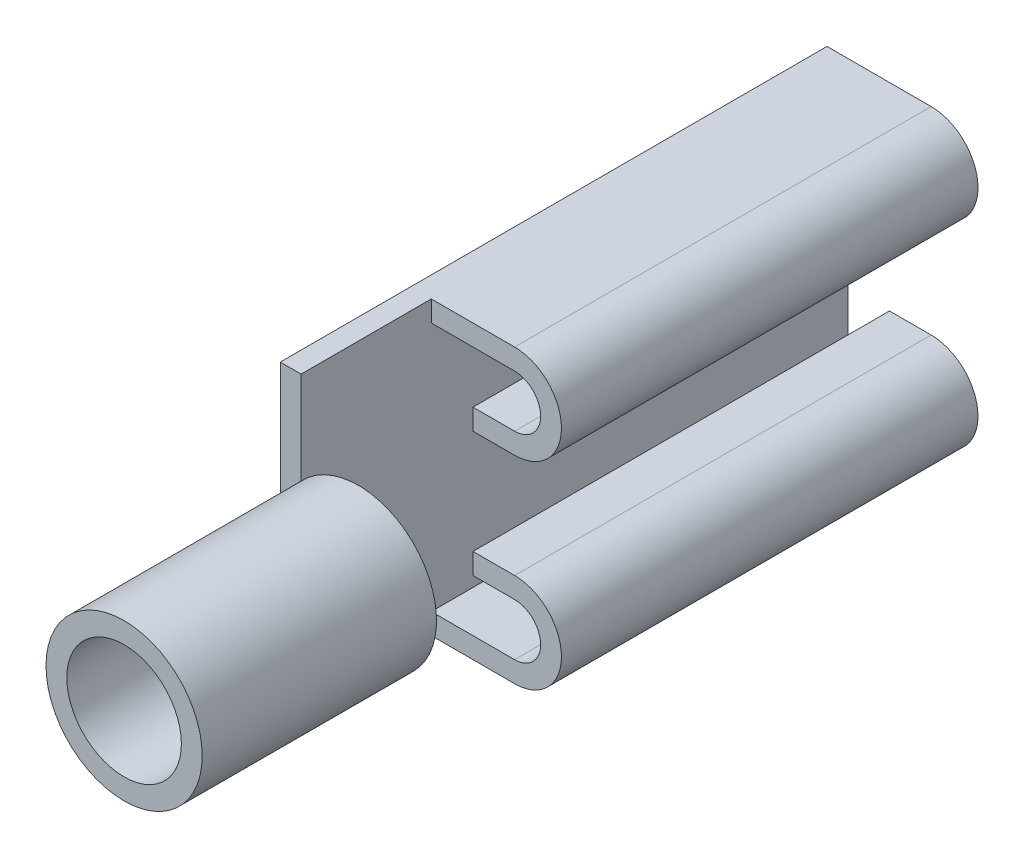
ISO-10303-21;
HEADER;
FILE_DESCRIPTION(('STEP AP214'),'2;1');
FILE_NAME('part.step','',(''),(''),'','','');
FILE_SCHEMA(('AUTOMOTIVE_DESIGN { 1 0 10303 214 1 1 1 1 }'));
ENDSEC;
DATA;
#1=APPLICATION_CONTEXT('core data for automotive mechanical design processes');
#2=APPLICATION_PROTOCOL_DEFINITION('international standard','automotive_design',2000,#1);
#3=PRODUCT_CONTEXT('',#1,'mechanical');
#4=PRODUCT('Part','Part','',(#3));
#5=PRODUCT_RELATED_PRODUCT_CATEGORY('part','',(#4));
#6=PRODUCT_DEFINITION_FORMATION('','',#4);
#7=PRODUCT_DEFINITION_CONTEXT('part definition',#1,'design');
#8=PRODUCT_DEFINITION('design','',#6,#7);
#9=PRODUCT_DEFINITION_SHAPE('','',#8);
#10=(LENGTH_UNIT() NAMED_UNIT(*) SI_UNIT(.MILLI.,.METRE.));
#11=(NAMED_UNIT(*) PLANE_ANGLE_UNIT() SI_UNIT($,.RADIAN.));
#12=(NAMED_UNIT(*) SI_UNIT($,.STERADIAN.) SOLID_ANGLE_UNIT());
#13=UNCERTAINTY_MEASURE_WITH_UNIT(LENGTH_MEASURE(1.E-05),#10,'distance_accuracy_value','');
#14=(GEOMETRIC_REPRESENTATION_CONTEXT(3) GLOBAL_UNCERTAINTY_ASSIGNED_CONTEXT((#13)) GLOBAL_UNIT_ASSIGNED_CONTEXT((#10,
#11,#12)) REPRESENTATION_CONTEXT('',''));
#15=CARTESIAN_POINT('',(0.,0.,0.));
#16=DIRECTION('',(0.,0.,1.));
#17=DIRECTION('',(1.,0.,0.));
#18=AXIS2_PLACEMENT_3D('',#15,#16,#17);
#19=CARTESIAN_POINT('',(-0.8,-2.8,10.5));
#20=DIRECTION('',(0.,0.,1.));
#21=DIRECTION('',(1.,0.,0.));
#22=AXIS2_PLACEMENT_3D('',#19,#20,#21);
#23=PLANE('',#22);
#24=CARTESIAN_POINT('',(0.7,0.,10.5));
#25=DIRECTION('',(0.,0.,1.));
#26=DIRECTION('',(1.,0.,0.));
#27=AXIS2_PLACEMENT_3D('',#24,#25,#26);
#28=CIRCLE('',#27,1.5);
#29=CARTESIAN_POINT('',(-0.4,1.01980390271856,10.5));
#30=VERTEX_POINT('',#29);
#31=CARTESIAN_POINT('',(-0.8,0.,10.5));
#32=VERTEX_POINT('',#31);
#33=EDGE_CURVE('E46',#30,#32,#28,.T.);
#34=ORIENTED_EDGE('',*,*,#33,.F.);
#35=DIRECTION('',(0.,1.,0.));
#36=VECTOR('',#35,1.);
#37=CARTESIAN_POINT('',(-0.400000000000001,2.8,10.5));
#38=LINE('',#37,#36);
#39=CARTESIAN_POINT('',(-0.400000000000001,2.8,10.5));
#40=VERTEX_POINT('',#39);
#41=EDGE_CURVE('E186',#30,#40,#38,.T.);
#42=ORIENTED_EDGE('',*,*,#41,.T.);
#43=DIRECTION('',(-1.,0.,0.));
#44=VECTOR('',#43,1.);
#45=CARTESIAN_POINT('',(-0.8,2.8,10.5));
#46=LINE('',#45,#44);
#47=CARTESIAN_POINT('',(-0.8,2.8,10.5));
#48=VERTEX_POINT('',#47);
#49=EDGE_CURVE('E183',#40,#48,#46,.T.);
#50=ORIENTED_EDGE('',*,*,#49,.T.);
#51=DIRECTION('',(0.,-1.,0.));
#52=VECTOR('',#51,1.);
#53=CARTESIAN_POINT('',(-0.8,2.8,10.5));
#54=LINE('',#53,#52);
#55=EDGE_CURVE('E202',#48,#32,#54,.T.);
#56=ORIENTED_EDGE('',*,*,#55,.T.);
#57=EDGE_LOOP('',(#34,#42,#50,#56));
#58=FACE_BOUND('',#57,.T.);
#59=ADVANCED_FACE('F35',(#58),#23,.T.);
#60=CARTESIAN_POINT('',(1.2,-1.9,8.));
#61=DIRECTION('',(0.,0.,1.));
#62=DIRECTION('',(1.,0.,0.));
#63=AXIS2_PLACEMENT_3D('',#60,#61,#62);
#64=PLANE('',#63);
#65=DIRECTION('',(0.,1.,0.));
#66=VECTOR('',#65,1.);
#67=CARTESIAN_POINT('',(-0.400000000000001,2.8,8.));
#68=LINE('',#67,#66);
#69=CARTESIAN_POINT('',(-0.4,-2.8,8.));
#70=VERTEX_POINT('',#69);
#71=CARTESIAN_POINT('',(-0.399999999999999,-2.4,8.));
#72=VERTEX_POINT('',#71);
#73=EDGE_CURVE('E198',#70,#72,#68,.T.);
#74=ORIENTED_EDGE('',*,*,#73,.F.);
#75=DIRECTION('',(1.,0.,0.));
#76=VECTOR('',#75,1.);
#77=CARTESIAN_POINT('',(1.2,-2.8,8.));
#78=LINE('',#77,#76);
#79=CARTESIAN_POINT('',(1.2,-2.8,8.));
#80=VERTEX_POINT('',#79);
#81=EDGE_CURVE('E218',#70,#80,#78,.T.);
#82=ORIENTED_EDGE('',*,*,#81,.T.);
#83=CARTESIAN_POINT('',(1.2,-1.9,8.));
#84=DIRECTION('',(0.,0.,1.));
#85=DIRECTION('',(-1.,0.,0.));
#86=AXIS2_PLACEMENT_3D('',#83,#84,#85);
#87=CIRCLE('',#86,0.9);
#88=CARTESIAN_POINT('',(1.2,-1.,8.));
#89=VERTEX_POINT('',#88);
#90=EDGE_CURVE('E331',#80,#89,#87,.T.);
#91=ORIENTED_EDGE('',*,*,#90,.T.);
#92=DIRECTION('',(-1.,0.,0.));
#93=VECTOR('',#92,1.);
#94=CARTESIAN_POINT('',(1.2,-1.,8.));
#95=LINE('',#94,#93);
#96=CARTESIAN_POINT('',(0.400000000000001,-1.,8.));
#97=VERTEX_POINT('',#96);
#98=EDGE_CURVE('E333',#89,#97,#95,.T.);
#99=ORIENTED_EDGE('',*,*,#98,.T.);
#100=DIRECTION('',(0.,-1.,0.));
#101=VECTOR('',#100,1.);
#102=CARTESIAN_POINT('',(0.400000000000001,-1.,8.));
#103=LINE('',#102,#101);
#104=CARTESIAN_POINT('',(0.400000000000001,-1.4,8.));
#105=VERTEX_POINT('',#104);
#106=EDGE_CURVE('E335',#97,#105,#103,.T.);
#107=ORIENTED_EDGE('',*,*,#106,.T.);
#108=DIRECTION('',(1.,0.,0.));
#109=VECTOR('',#108,1.);
#110=CARTESIAN_POINT('',(0.400000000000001,-1.4,8.));
#111=LINE('',#110,#109);
#112=CARTESIAN_POINT('',(1.2,-1.4,8.));
#113=VERTEX_POINT('',#112);
#114=EDGE_CURVE('E336',#105,#113,#111,.T.);
#115=ORIENTED_EDGE('',*,*,#114,.T.);
#116=CARTESIAN_POINT('',(1.2,-1.9,8.));
#117=DIRECTION('',(0.,0.,-1.));
#118=DIRECTION('',(1.,0.,0.));
#119=AXIS2_PLACEMENT_3D('',#116,#117,#118);
#120=CIRCLE('',#119,0.5);
#121=CARTESIAN_POINT('',(1.2,-2.4,8.));
#122=VERTEX_POINT('',#121);
#123=EDGE_CURVE('E240',#113,#122,#120,.T.);
#124=ORIENTED_EDGE('',*,*,#123,.T.);
#125=DIRECTION('',(-1.,0.,0.));
#126=VECTOR('',#125,1.);
#127=CARTESIAN_POINT('',(-0.399999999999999,-2.4,8.));
#128=LINE('',#127,#126);
#129=EDGE_CURVE('E237',#122,#72,#128,.T.);
#130=ORIENTED_EDGE('',*,*,#129,.T.);
#131=EDGE_LOOP('',(#74,#82,#91,#99,#107,#115,#124,#130));
#132=FACE_BOUND('',#131,.T.);
#133=ADVANCED_FACE('F342',(#132),#64,.T.);
#134=CARTESIAN_POINT('',(-0.4,2.4,8.));
#135=DIRECTION('',(-1.,0.,0.));
#136=DIRECTION('',(0.,-1.,0.));
#137=AXIS2_PLACEMENT_3D('',#134,#135,#136);
#138=PLANE('',#137);
#139=DIRECTION('',(0.,1.,0.));
#140=VECTOR('',#139,1.);
#141=CARTESIAN_POINT('',(-0.4,2.4,0.));
#142=LINE('',#141,#140);
#143=CARTESIAN_POINT('',(-0.399999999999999,-2.4,0.));
#144=VERTEX_POINT('',#143);
#145=CARTESIAN_POINT('',(-0.4,2.4,0.));
#146=VERTEX_POINT('',#145);
#147=EDGE_CURVE('E247',#144,#146,#142,.T.);
#148=ORIENTED_EDGE('',*,*,#147,.T.);
#149=DIRECTION('',(0.,0.,-1.));
#150=VECTOR('',#149,1.);
#151=CARTESIAN_POINT('',(-0.4,2.4,8.));
#152=LINE('',#151,#150);
#153=CARTESIAN_POINT('',(-0.4,2.4,8.));
#154=VERTEX_POINT('',#153);
#155=EDGE_CURVE('E217',#154,#146,#152,.T.);
#156=ORIENTED_EDGE('',*,*,#155,.F.);
#157=CARTESIAN_POINT('',(-0.400000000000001,2.8,8.));
#158=VERTEX_POINT('',#157);
#159=EDGE_CURVE('E44',#154,#158,#68,.T.);
#160=ORIENTED_EDGE('',*,*,#159,.T.);
#161=DIRECTION('',(0.,0.,-1.));
#162=VECTOR('',#161,1.);
#163=CARTESIAN_POINT('',(-0.400000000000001,2.8,10.5));
#164=LINE('',#163,#162);
#165=EDGE_CURVE('E208',#40,#158,#164,.T.);
#166=ORIENTED_EDGE('',*,*,#165,.F.);
#167=ORIENTED_EDGE('',*,*,#41,.F.);
#168=CARTESIAN_POINT('',(-0.4,0.,10.5));
#169=VERTEX_POINT('',#168);
#170=EDGE_CURVE('E60',#169,#30,#38,.T.);
#171=ORIENTED_EDGE('',*,*,#170,.F.);
#172=CARTESIAN_POINT('',(-0.4,-1.01980390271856,10.5));
#173=VERTEX_POINT('',#172);
#174=EDGE_CURVE('E184',#173,#169,#38,.T.);
#175=ORIENTED_EDGE('',*,*,#174,.F.);
#176=CARTESIAN_POINT('',(-0.4,-2.8,10.5));
#177=VERTEX_POINT('',#176);
#178=EDGE_CURVE('E176',#177,#173,#38,.T.);
#179=ORIENTED_EDGE('',*,*,#178,.F.);
#180=DIRECTION('',(0.,0.,-1.));
#181=VECTOR('',#180,1.);
#182=CARTESIAN_POINT('',(-0.4,-2.8,10.5));
#183=LINE('',#182,#181);
#184=EDGE_CURVE('E223',#177,#70,#183,.T.);
#185=ORIENTED_EDGE('',*,*,#184,.T.);
#186=ORIENTED_EDGE('',*,*,#73,.T.);
#187=DIRECTION('',(0.,0.,-1.));
#188=VECTOR('',#187,1.);
#189=CARTESIAN_POINT('',(-0.399999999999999,-2.4,8.));
#190=LINE('',#189,#188);
#191=EDGE_CURVE('E239',#72,#144,#190,.T.);
#192=ORIENTED_EDGE('',*,*,#191,.T.);
#193=EDGE_LOOP('',(#148,#156,#160,#166,#167,#171,#175,#179,#185,#186,#192));
#194=FACE_BOUND('',#193,.T.);
#195=ADVANCED_FACE('F37',(#194),#138,.F.);
#196=CARTESIAN_POINT('',(-0.4,2.4,8.));
#197=DIRECTION('',(0.,1.,0.));
#198=DIRECTION('',(0.,0.,1.));
#199=AXIS2_PLACEMENT_3D('',#196,#197,#198);
#200=PLANE('',#199);
#201=DIRECTION('',(1.,0.,0.));
#202=VECTOR('',#201,1.);
#203=CARTESIAN_POINT('',(-0.4,2.4,0.));
#204=LINE('',#203,#202);
#205=CARTESIAN_POINT('',(1.2,2.4,0.));
#206=VERTEX_POINT('',#205);
#207=EDGE_CURVE('E249',#146,#206,#204,.T.);
#208=ORIENTED_EDGE('',*,*,#207,.T.);
#209=DIRECTION('',(0.,0.,-1.));
#210=VECTOR('',#209,1.);
#211=CARTESIAN_POINT('',(1.2,2.4,8.));
#212=LINE('',#211,#210);
#213=CARTESIAN_POINT('',(1.2,2.4,8.));
#214=VERTEX_POINT('',#213);
#215=EDGE_CURVE('E234',#214,#206,#212,.T.);
#216=ORIENTED_EDGE('',*,*,#215,.F.);
#217=DIRECTION('',(1.,0.,0.));
#218=VECTOR('',#217,1.);
#219=CARTESIAN_POINT('',(-0.4,2.4,8.));
#220=LINE('',#219,#218);
#221=EDGE_CURVE('E226',#154,#214,#220,.T.);
#222=ORIENTED_EDGE('',*,*,#221,.F.);
#223=ORIENTED_EDGE('',*,*,#155,.T.);
#224=EDGE_LOOP('',(#208,#216,#222,#223));
#225=FACE_BOUND('',#224,.T.);
#226=ADVANCED_FACE('F386',(#225),#200,.F.);
#227=CARTESIAN_POINT('',(1.2,1.9,8.));
#228=DIRECTION('',(0.,0.,-1.));
#229=DIRECTION('',(-1.,0.,0.));
#230=AXIS2_PLACEMENT_3D('',#227,#228,#229);
#231=CYLINDRICAL_SURFACE('',#230,0.5);
#232=CARTESIAN_POINT('',(1.2,1.9,0.));
#233=DIRECTION('',(0.,0.,-1.));
#234=DIRECTION('',(-1.,0.,0.));
#235=AXIS2_PLACEMENT_3D('',#232,#233,#234);
#236=CIRCLE('',#235,0.5);
#237=CARTESIAN_POINT('',(1.2,1.4,0.));
#238=VERTEX_POINT('',#237);
#239=EDGE_CURVE('E253',#206,#238,#236,.T.);
#240=ORIENTED_EDGE('',*,*,#239,.T.);
#241=DIRECTION('',(0.,0.,-1.));
#242=VECTOR('',#241,1.);
#243=CARTESIAN_POINT('',(1.2,1.4,8.));
#244=LINE('',#243,#242);
#245=CARTESIAN_POINT('',(1.2,1.4,8.));
#246=VERTEX_POINT('',#245);
#247=EDGE_CURVE('E319',#246,#238,#244,.T.);
#248=ORIENTED_EDGE('',*,*,#247,.F.);
#249=CARTESIAN_POINT('',(1.2,1.9,8.));
#250=DIRECTION('',(0.,0.,-1.));
#251=DIRECTION('',(-1.,0.,0.));
#252=AXIS2_PLACEMENT_3D('',#249,#250,#251);
#253=CIRCLE('',#252,0.5);
#254=EDGE_CURVE('E228',#214,#246,#253,.T.);
#255=ORIENTED_EDGE('',*,*,#254,.F.);
#256=ORIENTED_EDGE('',*,*,#215,.T.);
#257=EDGE_LOOP('',(#240,#248,#255,#256));
#258=FACE_BOUND('',#257,.T.);
#259=ADVANCED_FACE('F419',(#258),#231,.F.);
#260=CARTESIAN_POINT('',(1.2,1.4,8.));
#261=DIRECTION('',(0.,-1.,0.));
#262=DIRECTION('',(0.,0.,-1.));
#263=AXIS2_PLACEMENT_3D('',#260,#261,#262);
#264=PLANE('',#263);
#265=DIRECTION('',(-1.,0.,0.));
#266=VECTOR('',#265,1.);
#267=CARTESIAN_POINT('',(1.2,1.4,0.));
#268=LINE('',#267,#266);
#269=CARTESIAN_POINT('',(0.400000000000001,1.4,0.));
#270=VERTEX_POINT('',#269);
#271=EDGE_CURVE('E259',#238,#270,#268,.T.);
#272=ORIENTED_EDGE('',*,*,#271,.T.);
#273=DIRECTION('',(0.,0.,-1.));
#274=VECTOR('',#273,1.);
#275=CARTESIAN_POINT('',(0.400000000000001,1.4,8.));
#276=LINE('',#275,#274);
#277=CARTESIAN_POINT('',(0.400000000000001,1.4,8.));
#278=VERTEX_POINT('',#277);
#279=EDGE_CURVE('E316',#278,#270,#276,.T.);
#280=ORIENTED_EDGE('',*,*,#279,.F.);
#281=DIRECTION('',(-1.,0.,0.));
#282=VECTOR('',#281,1.);
#283=CARTESIAN_POINT('',(1.2,1.4,8.));
#284=LINE('',#283,#282);
#285=EDGE_CURVE('E415',#246,#278,#284,.T.);
#286=ORIENTED_EDGE('',*,*,#285,.F.);
#287=ORIENTED_EDGE('',*,*,#247,.T.);
#288=EDGE_LOOP('',(#272,#280,#286,#287));
#289=FACE_BOUND('',#288,.T.);
#290=ADVANCED_FACE('F414',(#289),#264,.F.);
#291=CARTESIAN_POINT('',(0.400000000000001,1.,8.));
#292=DIRECTION('',(1.,0.,0.));
#293=DIRECTION('',(0.,0.,-1.));
#294=AXIS2_PLACEMENT_3D('',#291,#292,#293);
#295=PLANE('',#294);
#296=DIRECTION('',(0.,-1.,0.));
#297=VECTOR('',#296,1.);
#298=CARTESIAN_POINT('',(0.400000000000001,1.,0.));
#299=LINE('',#298,#297);
#300=CARTESIAN_POINT('',(0.400000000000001,1.,0.));
#301=VERTEX_POINT('',#300);
#302=EDGE_CURVE('E261',#270,#301,#299,.T.);
#303=ORIENTED_EDGE('',*,*,#302,.T.);
#304=DIRECTION('',(0.,0.,-1.));
#305=VECTOR('',#304,1.);
#306=CARTESIAN_POINT('',(0.400000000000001,1.,8.));
#307=LINE('',#306,#305);
#308=CARTESIAN_POINT('',(0.400000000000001,1.,8.));
#309=VERTEX_POINT('',#308);
#310=EDGE_CURVE('E313',#309,#301,#307,.T.);
#311=ORIENTED_EDGE('',*,*,#310,.F.);
#312=DIRECTION('',(0.,-1.,0.));
#313=VECTOR('',#312,1.);
#314=CARTESIAN_POINT('',(0.400000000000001,1.,8.));
#315=LINE('',#314,#313);
#316=EDGE_CURVE('E411',#278,#309,#315,.T.);
#317=ORIENTED_EDGE('',*,*,#316,.F.);
#318=ORIENTED_EDGE('',*,*,#279,.T.);
#319=EDGE_LOOP('',(#303,#311,#317,#318));
#320=FACE_BOUND('',#319,.T.);
#321=ADVANCED_FACE('F408',(#320),#295,.F.);
#322=CARTESIAN_POINT('',(1.2,1.,8.));
#323=DIRECTION('',(0.,1.,0.));
#324=DIRECTION('',(0.,0.,1.));
#325=AXIS2_PLACEMENT_3D('',#322,#323,#324);
#326=PLANE('',#325);
#327=DIRECTION('',(1.,0.,0.));
#328=VECTOR('',#327,1.);
#329=CARTESIAN_POINT('',(1.2,1.,0.));
#330=LINE('',#329,#328);
#331=CARTESIAN_POINT('',(1.2,1.,0.));
#332=VERTEX_POINT('',#331);
#333=EDGE_CURVE('E263',#301,#332,#330,.T.);
#334=ORIENTED_EDGE('',*,*,#333,.T.);
#335=DIRECTION('',(0.,0.,-1.));
#336=VECTOR('',#335,1.);
#337=CARTESIAN_POINT('',(1.2,1.,8.));
#338=LINE('',#337,#336);
#339=CARTESIAN_POINT('',(1.2,1.,8.));
#340=VERTEX_POINT('',#339);
#341=EDGE_CURVE('E310',#340,#332,#338,.T.);
#342=ORIENTED_EDGE('',*,*,#341,.F.);
#343=DIRECTION('',(1.,0.,0.));
#344=VECTOR('',#343,1.);
#345=CARTESIAN_POINT('',(1.2,1.,8.));
#346=LINE('',#345,#344);
#347=EDGE_CURVE('E404',#309,#340,#346,.T.);
#348=ORIENTED_EDGE('',*,*,#347,.F.);
#349=ORIENTED_EDGE('',*,*,#310,.T.);
#350=EDGE_LOOP('',(#334,#342,#348,#349));
#351=FACE_BOUND('',#350,.T.);
#352=ADVANCED_FACE('F403',(#351),#326,.F.);
#353=CARTESIAN_POINT('',(1.2,1.9,8.));
#354=DIRECTION('',(0.,0.,-1.));
#355=DIRECTION('',(-1.,0.,0.));
#356=AXIS2_PLACEMENT_3D('',#353,#354,#355);
#357=CYLINDRICAL_SURFACE('',#356,0.9);
#358=CARTESIAN_POINT('',(1.2,1.9,0.));
#359=DIRECTION('',(0.,0.,1.));
#360=DIRECTION('',(1.,0.,0.));
#361=AXIS2_PLACEMENT_3D('',#358,#359,#360);
#362=CIRCLE('',#361,0.9);
#363=CARTESIAN_POINT('',(1.2,2.8,0.));
#364=VERTEX_POINT('',#363);
#365=EDGE_CURVE('E265',#332,#364,#362,.T.);
#366=ORIENTED_EDGE('',*,*,#365,.T.);
#367=DIRECTION('',(0.,0.,-1.));
#368=VECTOR('',#367,1.);
#369=CARTESIAN_POINT('',(1.2,2.8,8.));
#370=LINE('',#369,#368);
#371=CARTESIAN_POINT('',(1.2,2.8,8.));
#372=VERTEX_POINT('',#371);
#373=EDGE_CURVE('E307',#372,#364,#370,.T.);
#374=ORIENTED_EDGE('',*,*,#373,.F.);
#375=CARTESIAN_POINT('',(1.2,1.9,8.));
#376=DIRECTION('',(0.,0.,1.));
#377=DIRECTION('',(1.,0.,0.));
#378=AXIS2_PLACEMENT_3D('',#375,#376,#377);
#379=CIRCLE('',#378,0.9);
#380=EDGE_CURVE('E325',#340,#372,#379,.T.);
#381=ORIENTED_EDGE('',*,*,#380,.F.);
#382=ORIENTED_EDGE('',*,*,#341,.T.);
#383=EDGE_LOOP('',(#366,#374,#381,#382));
#384=FACE_BOUND('',#383,.T.);
#385=ADVANCED_FACE('F399',(#384),#357,.T.);
#386=CARTESIAN_POINT('',(-0.8,2.8,8.));
#387=DIRECTION('',(0.,-1.,0.));
#388=DIRECTION('',(0.,0.,-1.));
#389=AXIS2_PLACEMENT_3D('',#386,#387,#388);
#390=PLANE('',#389);
#391=DIRECTION('',(-1.,0.,0.));
#392=VECTOR('',#391,1.);
#393=CARTESIAN_POINT('',(-0.8,2.8,0.));
#394=LINE('',#393,#392);
#395=CARTESIAN_POINT('',(-0.8,2.8,0.));
#396=VERTEX_POINT('',#395);
#397=EDGE_CURVE('E267',#364,#396,#394,.T.);
#398=ORIENTED_EDGE('',*,*,#397,.T.);
#399=DIRECTION('',(0.,0.,-1.));
#400=VECTOR('',#399,1.);
#401=CARTESIAN_POINT('',(-0.8,2.8,8.));
#402=LINE('',#401,#400);
#403=EDGE_CURVE('E304',#48,#396,#402,.T.);
#404=ORIENTED_EDGE('',*,*,#403,.F.);
#405=ORIENTED_EDGE('',*,*,#49,.F.);
#406=ORIENTED_EDGE('',*,*,#165,.T.);
#407=DIRECTION('',(-1.,0.,0.));
#408=VECTOR('',#407,1.);
#409=CARTESIAN_POINT('',(-0.8,2.8,8.));
#410=LINE('',#409,#408);
#411=EDGE_CURVE('E323',#372,#158,#410,.T.);
#412=ORIENTED_EDGE('',*,*,#411,.F.);
#413=ORIENTED_EDGE('',*,*,#373,.T.);
#414=EDGE_LOOP('',(#398,#404,#405,#406,#412,#413));
#415=FACE_BOUND('',#414,.T.);
#416=ADVANCED_FACE('F392',(#415),#390,.F.);
#417=CARTESIAN_POINT('',(-0.8,2.8,8.));
#418=DIRECTION('',(1.,0.,0.));
#419=DIRECTION('',(0.,0.,-1.));
#420=AXIS2_PLACEMENT_3D('',#417,#418,#419);
#421=PLANE('',#420);
#422=DIRECTION('',(0.,-1.,0.));
#423=VECTOR('',#422,1.);
#424=CARTESIAN_POINT('',(-0.8,2.8,0.));
#425=LINE('',#424,#423);
#426=CARTESIAN_POINT('',(-0.8,-2.8,0.));
#427=VERTEX_POINT('',#426);
#428=EDGE_CURVE('E269',#396,#427,#425,.T.);
#429=ORIENTED_EDGE('',*,*,#428,.T.);
#430=DIRECTION('',(0.,0.,-1.));
#431=VECTOR('',#430,1.);
#432=CARTESIAN_POINT('',(-0.8,-2.8,8.));
#433=LINE('',#432,#431);
#434=CARTESIAN_POINT('',(-0.8,-2.8,10.5));
#435=VERTEX_POINT('',#434);
#436=EDGE_CURVE('E301',#435,#427,#433,.T.);
#437=ORIENTED_EDGE('',*,*,#436,.F.);
#438=EDGE_CURVE('E204',#32,#435,#54,.T.);
#439=ORIENTED_EDGE('',*,*,#438,.F.);
#440=ORIENTED_EDGE('',*,*,#55,.F.);
#441=ORIENTED_EDGE('',*,*,#403,.T.);
#442=EDGE_LOOP('',(#429,#437,#439,#440,#441));
#443=FACE_BOUND('',#442,.T.);
#444=ADVANCED_FACE('F355',(#443),#421,.F.);
#445=CARTESIAN_POINT('',(1.2,-2.8,8.));
#446=DIRECTION('',(0.,1.,0.));
#447=DIRECTION('',(0.,0.,1.));
#448=AXIS2_PLACEMENT_3D('',#445,#446,#447);
#449=PLANE('',#448);
#450=DIRECTION('',(1.,0.,0.));
#451=VECTOR('',#450,1.);
#452=CARTESIAN_POINT('',(1.2,-2.8,0.));
#453=LINE('',#452,#451);
#454=CARTESIAN_POINT('',(1.2,-2.8,0.));
#455=VERTEX_POINT('',#454);
#456=EDGE_CURVE('E271',#427,#455,#453,.T.);
#457=ORIENTED_EDGE('',*,*,#456,.T.);
#458=DIRECTION('',(0.,0.,-1.));
#459=VECTOR('',#458,1.);
#460=CARTESIAN_POINT('',(1.2,-2.8,8.));
#461=LINE('',#460,#459);
#462=EDGE_CURVE('E298',#80,#455,#461,.T.);
#463=ORIENTED_EDGE('',*,*,#462,.F.);
#464=ORIENTED_EDGE('',*,*,#81,.F.);
#465=ORIENTED_EDGE('',*,*,#184,.F.);
#466=DIRECTION('',(1.,0.,0.));
#467=VECTOR('',#466,1.);
#468=CARTESIAN_POINT('',(-0.8,-2.8,10.5));
#469=LINE('',#468,#467);
#470=EDGE_CURVE('E180',#435,#177,#469,.T.);
#471=ORIENTED_EDGE('',*,*,#470,.F.);
#472=ORIENTED_EDGE('',*,*,#436,.T.);
#473=EDGE_LOOP('',(#457,#463,#464,#465,#471,#472));
#474=FACE_BOUND('',#473,.T.);
#475=ADVANCED_FACE('F359',(#474),#449,.F.);
#476=CARTESIAN_POINT('',(1.2,-1.9,8.));
#477=DIRECTION('',(0.,0.,-1.));
#478=DIRECTION('',(-1.,0.,0.));
#479=AXIS2_PLACEMENT_3D('',#476,#477,#478);
#480=CYLINDRICAL_SURFACE('',#479,0.9);
#481=CARTESIAN_POINT('',(1.2,-1.9,0.));
#482=DIRECTION('',(0.,0.,1.));
#483=DIRECTION('',(-1.,0.,0.));
#484=AXIS2_PLACEMENT_3D('',#481,#482,#483);
#485=CIRCLE('',#484,0.9);
#486=CARTESIAN_POINT('',(1.2,-1.,0.));
#487=VERTEX_POINT('',#486);
#488=EDGE_CURVE('E273',#455,#487,#485,.T.);
#489=ORIENTED_EDGE('',*,*,#488,.T.);
#490=DIRECTION('',(0.,0.,-1.));
#491=VECTOR('',#490,1.);
#492=CARTESIAN_POINT('',(1.2,-1.,8.));
#493=LINE('',#492,#491);
#494=EDGE_CURVE('E295',#89,#487,#493,.T.);
#495=ORIENTED_EDGE('',*,*,#494,.F.);
#496=ORIENTED_EDGE('',*,*,#90,.F.);
#497=ORIENTED_EDGE('',*,*,#462,.T.);
#498=EDGE_LOOP('',(#489,#495,#496,#497));
#499=FACE_BOUND('',#498,.T.);
#500=ADVANCED_FACE('F366',(#499),#480,.T.);
#501=CARTESIAN_POINT('',(1.2,-1.,8.));
#502=DIRECTION('',(0.,-1.,0.));
#503=DIRECTION('',(0.,0.,-1.));
#504=AXIS2_PLACEMENT_3D('',#501,#502,#503);
#505=PLANE('',#504);
#506=DIRECTION('',(-1.,0.,0.));
#507=VECTOR('',#506,1.);
#508=CARTESIAN_POINT('',(1.2,-1.,0.));
#509=LINE('',#508,#507);
#510=CARTESIAN_POINT('',(0.400000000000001,-1.,0.));
#511=VERTEX_POINT('',#510);
#512=EDGE_CURVE('E275',#487,#511,#509,.T.);
#513=ORIENTED_EDGE('',*,*,#512,.T.);
#514=DIRECTION('',(0.,0.,-1.));
#515=VECTOR('',#514,1.);
#516=CARTESIAN_POINT('',(0.400000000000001,-1.,8.));
#517=LINE('',#516,#515);
#518=EDGE_CURVE('E292',#97,#511,#517,.T.);
#519=ORIENTED_EDGE('',*,*,#518,.F.);
#520=ORIENTED_EDGE('',*,*,#98,.F.);
#521=ORIENTED_EDGE('',*,*,#494,.T.);
#522=EDGE_LOOP('',(#513,#519,#520,#521));
#523=FACE_BOUND('',#522,.T.);
#524=ADVANCED_FACE('F370',(#523),#505,.F.);
#525=CARTESIAN_POINT('',(0.400000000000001,-1.,8.));
#526=DIRECTION('',(1.,0.,0.));
#527=DIRECTION('',(0.,0.,-1.));
#528=AXIS2_PLACEMENT_3D('',#525,#526,#527);
#529=PLANE('',#528);
#530=DIRECTION('',(0.,-1.,0.));
#531=VECTOR('',#530,1.);
#532=CARTESIAN_POINT('',(0.400000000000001,-1.,0.));
#533=LINE('',#532,#531);
#534=CARTESIAN_POINT('',(0.400000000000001,-1.4,0.));
#535=VERTEX_POINT('',#534);
#536=EDGE_CURVE('E277',#511,#535,#533,.T.);
#537=ORIENTED_EDGE('',*,*,#536,.T.);
#538=DIRECTION('',(0.,0.,-1.));
#539=VECTOR('',#538,1.);
#540=CARTESIAN_POINT('',(0.400000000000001,-1.4,8.));
#541=LINE('',#540,#539);
#542=EDGE_CURVE('E289',#105,#535,#541,.T.);
#543=ORIENTED_EDGE('',*,*,#542,.F.);
#544=ORIENTED_EDGE('',*,*,#106,.F.);
#545=ORIENTED_EDGE('',*,*,#518,.T.);
#546=EDGE_LOOP('',(#537,#543,#544,#545));
#547=FACE_BOUND('',#546,.T.);
#548=ADVANCED_FACE('F375',(#547),#529,.F.);
#549=CARTESIAN_POINT('',(0.400000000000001,-1.4,8.));
#550=DIRECTION('',(0.,1.,0.));
#551=DIRECTION('',(0.,0.,1.));
#552=AXIS2_PLACEMENT_3D('',#549,#550,#551);
#553=PLANE('',#552);
#554=DIRECTION('',(1.,0.,0.));
#555=VECTOR('',#554,1.);
#556=CARTESIAN_POINT('',(0.400000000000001,-1.4,0.));
#557=LINE('',#556,#555);
#558=CARTESIAN_POINT('',(1.2,-1.4,0.));
#559=VERTEX_POINT('',#558);
#560=EDGE_CURVE('E279',#535,#559,#557,.T.);
#561=ORIENTED_EDGE('',*,*,#560,.T.);
#562=DIRECTION('',(0.,0.,-1.));
#563=VECTOR('',#562,1.);
#564=CARTESIAN_POINT('',(1.2,-1.4,8.));
#565=LINE('',#564,#563);
#566=EDGE_CURVE('E286',#113,#559,#565,.T.);
#567=ORIENTED_EDGE('',*,*,#566,.F.);
#568=ORIENTED_EDGE('',*,*,#114,.F.);
#569=ORIENTED_EDGE('',*,*,#542,.T.);
#570=EDGE_LOOP('',(#561,#567,#568,#569));
#571=FACE_BOUND('',#570,.T.);
#572=ADVANCED_FACE('F378',(#571),#553,.F.);
#573=CARTESIAN_POINT('',(1.2,-1.9,8.));
#574=DIRECTION('',(0.,0.,-1.));
#575=DIRECTION('',(-1.,0.,0.));
#576=AXIS2_PLACEMENT_3D('',#573,#574,#575);
#577=CYLINDRICAL_SURFACE('',#576,0.5);
#578=CARTESIAN_POINT('',(1.2,-1.9,0.));
#579=DIRECTION('',(0.,0.,-1.));
#580=DIRECTION('',(1.,0.,0.));
#581=AXIS2_PLACEMENT_3D('',#578,#579,#580);
#582=CIRCLE('',#581,0.5);
#583=CARTESIAN_POINT('',(1.2,-2.4,0.));
#584=VERTEX_POINT('',#583);
#585=EDGE_CURVE('E281',#559,#584,#582,.T.);
#586=ORIENTED_EDGE('',*,*,#585,.T.);
#587=DIRECTION('',(0.,0.,-1.));
#588=VECTOR('',#587,1.);
#589=CARTESIAN_POINT('',(1.2,-2.4,8.));
#590=LINE('',#589,#588);
#591=EDGE_CURVE('E245',#122,#584,#590,.T.);
#592=ORIENTED_EDGE('',*,*,#591,.F.);
#593=ORIENTED_EDGE('',*,*,#123,.F.);
#594=ORIENTED_EDGE('',*,*,#566,.T.);
#595=EDGE_LOOP('',(#586,#592,#593,#594));
#596=FACE_BOUND('',#595,.T.);
#597=ADVANCED_FACE('F346',(#596),#577,.F.);
#598=CARTESIAN_POINT('',(-0.399999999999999,-2.4,8.));
#599=DIRECTION('',(0.,-1.,0.));
#600=DIRECTION('',(0.,0.,-1.));
#601=AXIS2_PLACEMENT_3D('',#598,#599,#600);
#602=PLANE('',#601);
#603=DIRECTION('',(-1.,0.,0.));
#604=VECTOR('',#603,1.);
#605=CARTESIAN_POINT('',(-0.399999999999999,-2.4,0.));
#606=LINE('',#605,#604);
#607=EDGE_CURVE('E229',#584,#144,#606,.T.);
#608=ORIENTED_EDGE('',*,*,#607,.T.);
#609=ORIENTED_EDGE('',*,*,#191,.F.);
#610=ORIENTED_EDGE('',*,*,#129,.F.);
#611=ORIENTED_EDGE('',*,*,#591,.T.);
#612=EDGE_LOOP('',(#608,#609,#610,#611));
#613=FACE_BOUND('',#612,.T.);
#614=ADVANCED_FACE('F350',(#613),#602,.F.);
#615=ORIENTED_EDGE('',*,*,#159,.F.);
#616=ORIENTED_EDGE('',*,*,#221,.T.);
#617=ORIENTED_EDGE('',*,*,#254,.T.);
#618=ORIENTED_EDGE('',*,*,#285,.T.);
#619=ORIENTED_EDGE('',*,*,#316,.T.);
#620=ORIENTED_EDGE('',*,*,#347,.T.);
#621=ORIENTED_EDGE('',*,*,#380,.T.);
#622=ORIENTED_EDGE('',*,*,#411,.T.);
#623=EDGE_LOOP('',(#615,#616,#617,#618,#619,#620,#621,#622));
#624=FACE_BOUND('',#623,.T.);
#625=ADVANCED_FACE('F422',(#624),#64,.T.);
#626=CARTESIAN_POINT('',(1.2,-1.9,0.));
#627=DIRECTION('',(0.,0.,1.));
#628=DIRECTION('',(1.,0.,0.));
#629=AXIS2_PLACEMENT_3D('',#626,#627,#628);
#630=PLANE('',#629);
#631=ORIENTED_EDGE('',*,*,#147,.F.);
#632=ORIENTED_EDGE('',*,*,#607,.F.);
#633=ORIENTED_EDGE('',*,*,#585,.F.);
#634=ORIENTED_EDGE('',*,*,#560,.F.);
#635=ORIENTED_EDGE('',*,*,#536,.F.);
#636=ORIENTED_EDGE('',*,*,#512,.F.);
#637=ORIENTED_EDGE('',*,*,#488,.F.);
#638=ORIENTED_EDGE('',*,*,#456,.F.);
#639=ORIENTED_EDGE('',*,*,#428,.F.);
#640=ORIENTED_EDGE('',*,*,#397,.F.);
#641=ORIENTED_EDGE('',*,*,#365,.F.);
#642=ORIENTED_EDGE('',*,*,#333,.F.);
#643=ORIENTED_EDGE('',*,*,#302,.F.);
#644=ORIENTED_EDGE('',*,*,#271,.F.);
#645=ORIENTED_EDGE('',*,*,#239,.F.);
#646=ORIENTED_EDGE('',*,*,#207,.F.);
#647=EDGE_LOOP('',(#631,#632,#633,#634,#635,#636,#637,#638,#639,#640,#641,#642,#643,#644,#645,#646));
#648=FACE_BOUND('',#647,.T.);
#649=ADVANCED_FACE('F380',(#648),#630,.F.);
#650=EDGE_CURVE('E11',#32,#173,#28,.T.);
#651=ORIENTED_EDGE('',*,*,#650,.F.);
#652=ORIENTED_EDGE('',*,*,#438,.T.);
#653=ORIENTED_EDGE('',*,*,#470,.T.);
#654=ORIENTED_EDGE('',*,*,#178,.T.);
#655=EDGE_LOOP('',(#651,#652,#653,#654));
#656=FACE_BOUND('',#655,.T.);
#657=ADVANCED_FACE('F177',(#656),#23,.T.);
#658=CARTESIAN_POINT('',(0.7,0.,10.5));
#659=DIRECTION('',(0.,0.,1.));
#660=DIRECTION('',(1.,0.,0.));
#661=AXIS2_PLACEMENT_3D('',#658,#659,#660);
#662=PLANE('',#661);
#663=EDGE_CURVE('E47',#173,#30,#28,.T.);
#664=ORIENTED_EDGE('',*,*,#663,.F.);
#665=ORIENTED_EDGE('',*,*,#174,.T.);
#666=CARTESIAN_POINT('',(0.7,0.,10.5));
#667=DIRECTION('',(0.,0.,1.));
#668=DIRECTION('',(1.,0.,0.));
#669=AXIS2_PLACEMENT_3D('',#666,#667,#668);
#670=CIRCLE('',#669,1.1);
#671=EDGE_CURVE('E460',#169,#169,#670,.T.);
#672=ORIENTED_EDGE('',*,*,#671,.T.);
#673=ORIENTED_EDGE('',*,*,#170,.T.);
#674=EDGE_LOOP('',(#664,#665,#672,#673));
#675=FACE_BOUND('',#674,.T.);
#676=ADVANCED_FACE('F192',(#675),#662,.F.);
#677=CARTESIAN_POINT('',(0.7,0.,15.));
#678=DIRECTION('',(0.,0.,1.));
#679=DIRECTION('',(1.,0.,0.));
#680=AXIS2_PLACEMENT_3D('',#677,#678,#679);
#681=PLANE('',#680);
#682=CARTESIAN_POINT('',(0.7,0.,15.));
#683=DIRECTION('',(0.,0.,1.));
#684=DIRECTION('',(1.,0.,0.));
#685=AXIS2_PLACEMENT_3D('',#682,#683,#684);
#686=CIRCLE('',#685,1.5);
#687=CARTESIAN_POINT('',(2.2,0.,15.));
#688=VERTEX_POINT('',#687);
#689=EDGE_CURVE('E196',#688,#688,#686,.T.);
#690=ORIENTED_EDGE('',*,*,#689,.T.);
#691=EDGE_LOOP('',(#690));
#692=FACE_BOUND('',#691,.T.);
#693=CARTESIAN_POINT('',(0.7,0.,15.));
#694=DIRECTION('',(0.,0.,1.));
#695=DIRECTION('',(1.,0.,0.));
#696=AXIS2_PLACEMENT_3D('',#693,#694,#695);
#697=CIRCLE('',#696,1.1);
#698=CARTESIAN_POINT('',(1.8,0.,15.));
#699=VERTEX_POINT('',#698);
#700=EDGE_CURVE('E194',#699,#699,#697,.T.);
#701=ORIENTED_EDGE('',*,*,#700,.F.);
#702=EDGE_LOOP('',(#701));
#703=FACE_BOUND('',#702,.T.);
#704=ADVANCED_FACE('F441',(#692,#703),#681,.T.);
#705=CARTESIAN_POINT('',(0.7,0.,15.));
#706=DIRECTION('',(0.,0.,-1.));
#707=DIRECTION('',(-1.,0.,0.));
#708=AXIS2_PLACEMENT_3D('',#705,#706,#707);
#709=CYLINDRICAL_SURFACE('',#708,1.5);
#710=ORIENTED_EDGE('',*,*,#689,.F.);
#711=EDGE_LOOP('',(#710));
#712=FACE_BOUND('',#711,.T.);
#713=ORIENTED_EDGE('',*,*,#33,.T.);
#714=ORIENTED_EDGE('',*,*,#650,.T.);
#715=ORIENTED_EDGE('',*,*,#663,.T.);
#716=EDGE_LOOP('',(#713,#714,#715));
#717=FACE_BOUND('',#716,.T.);
#718=ADVANCED_FACE('F195',(#712,#717),#709,.T.);
#719=CARTESIAN_POINT('',(0.7,0.,15.));
#720=DIRECTION('',(0.,0.,-1.));
#721=DIRECTION('',(-1.,0.,0.));
#722=AXIS2_PLACEMENT_3D('',#719,#720,#721);
#723=CYLINDRICAL_SURFACE('',#722,1.1);
#724=ORIENTED_EDGE('',*,*,#700,.T.);
#725=EDGE_LOOP('',(#724));
#726=FACE_BOUND('',#725,.T.);
#727=ORIENTED_EDGE('',*,*,#671,.F.);
#728=EDGE_LOOP('',(#727));
#729=FACE_BOUND('',#728,.T.);
#730=ADVANCED_FACE('F450',(#726,#729),#723,.F.);
#731=CLOSED_SHELL('',(#59,#133,#195,#226,#259,#290,#321,#352,#385,#416,#444,#475,#500,#524,#548,
#572,#597,#614,#625,#649,#657,#676,#704,#718,#730));
#732=MANIFOLD_SOLID_BREP('B2',#731);
#733=ADVANCED_BREP_SHAPE_REPRESENTATION('',(#18,#732),#14);
#734=SHAPE_DEFINITION_REPRESENTATION(#9,#733);
ENDSEC;
END-ISO-10303-21;
